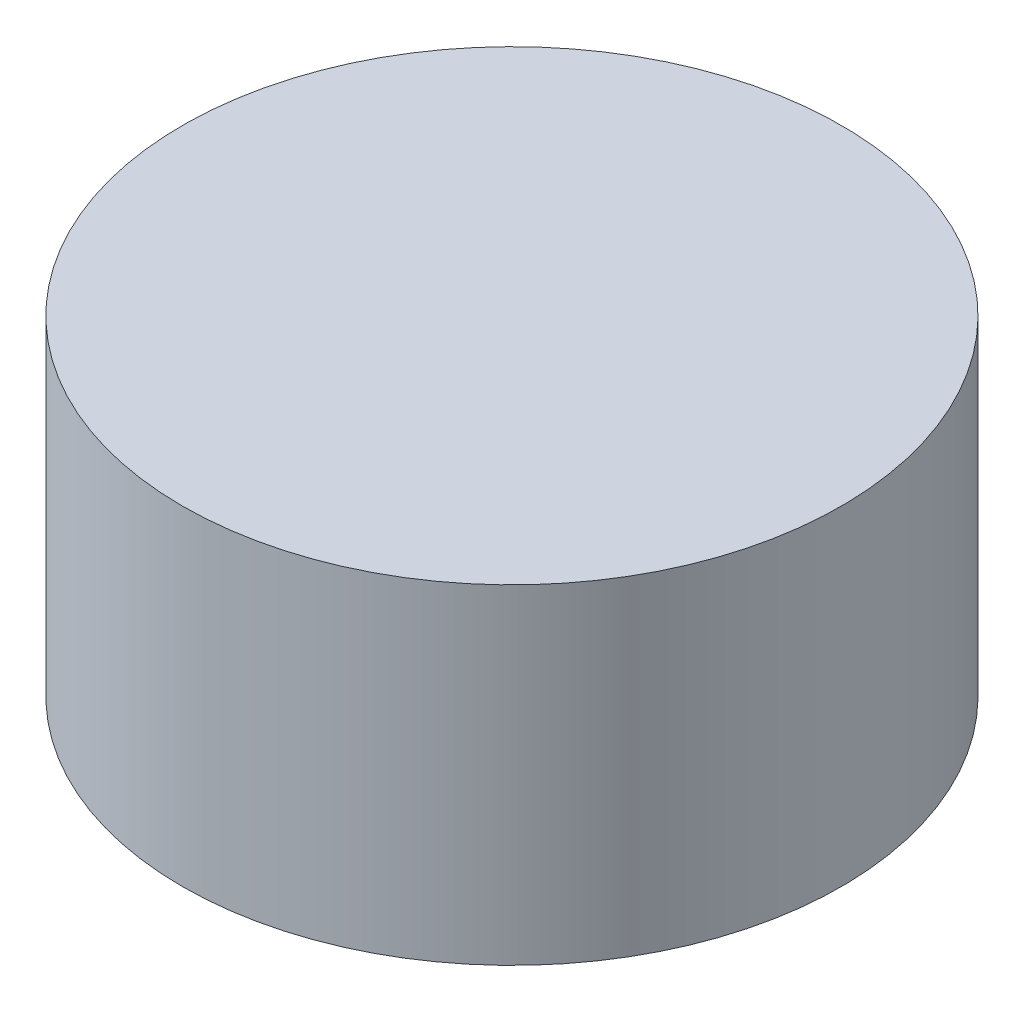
from build123d import *

# Parameters (mm, degrees)
SKETCH1_R           = 0.79375
BOSS_EXTRUDE1_DEPTH = 0.79375


with BuildPart() as part:
    # Sketch1 → Boss-Extrude1 (new body)
    with BuildSketch(Plane(origin=(0, 0, 0), x_dir=(1, 0, 0), z_dir=(0, 1, 0))):
        with Locations(Location((0, 12.7, 0), (0, 0, 270))):
            Circle(SKETCH1_R)
    extrude(amount=-BOSS_EXTRUDE1_DEPTH)


solid = part.part
